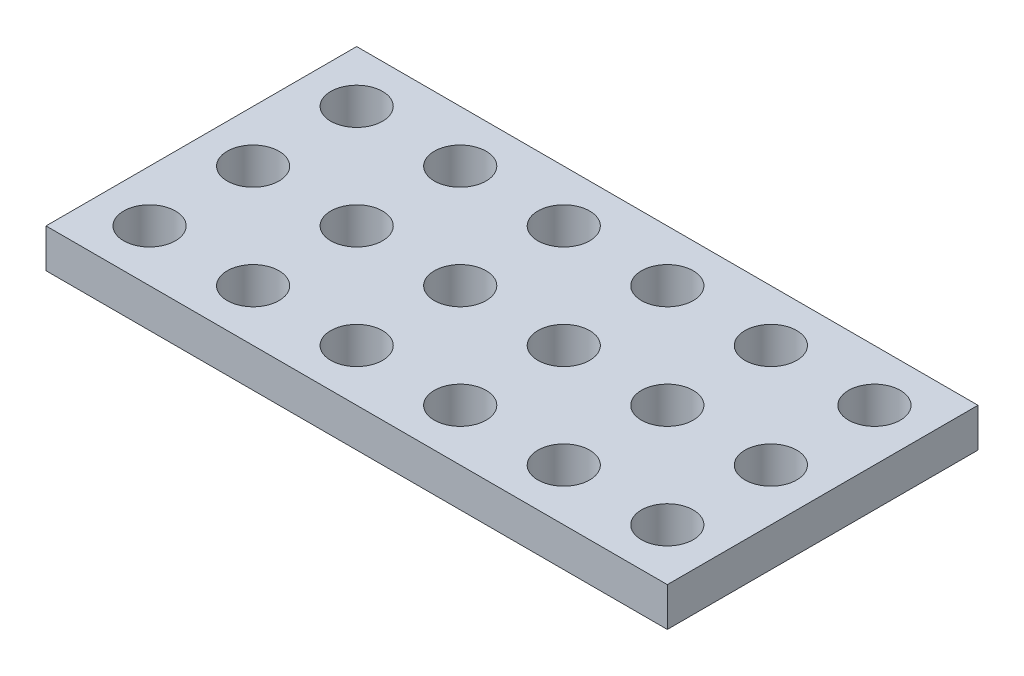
from build123d import *

# Parameters (mm, degrees)
SKETCH_1_W      = 48
SKETCH_1_H      = 24
SKETCH_1_R      = 2
EXTRUDE_1_DEPTH = 3


with BuildPart() as part:
    # Sketch 1 → Extrude 1 (new body)
    with BuildSketch(Plane(origin=(0, 0, 0), x_dir=(1, 0, 0), z_dir=(0, 1, 0))):
        with Locations((2.266666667, -1.066666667)):
            Rectangle(SKETCH_1_W, SKETCH_1_H)
        with Locations(Location((-17.733333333, 6.933333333, 0), (0, 0, 270))):
            Circle(SKETCH_1_R, mode=Mode.SUBTRACT)
        with Locations(Location((-9.733333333, 6.933333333, 0), (0, 0, 270))):
            Circle(SKETCH_1_R, mode=Mode.SUBTRACT)
        with Locations(Location((-1.733333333, 6.933333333, 0), (0, 0, 270))):
            Circle(SKETCH_1_R, mode=Mode.SUBTRACT)
        with Locations(Location((6.266666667, 6.933333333, 0), (0, 0, 270))):
            Circle(SKETCH_1_R, mode=Mode.SUBTRACT)
        with Locations(Location((14.266666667, 6.933333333, 0), (0, 0, 270))):
            Circle(SKETCH_1_R, mode=Mode.SUBTRACT)
        with Locations(Location((22.266666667, 6.933333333, 0), (0, 0, 270))):
            Circle(SKETCH_1_R, mode=Mode.SUBTRACT)
        with Locations(Location((-17.733333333, -1.066666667, 0), (0, 0, 270))):
            Circle(SKETCH_1_R, mode=Mode.SUBTRACT)
        with Locations(Location((-9.733333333, -1.066666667, 0), (0, 0, 270))):
            Circle(SKETCH_1_R, mode=Mode.SUBTRACT)
        with Locations(Location((-1.733333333, -1.066666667, 0), (0, 0, 270))):
            Circle(SKETCH_1_R, mode=Mode.SUBTRACT)
        with Locations(Location((6.266666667, -1.066666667, 0), (0, 0, 270))):
            Circle(SKETCH_1_R, mode=Mode.SUBTRACT)
        with Locations(Location((14.266666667, -1.066666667, 0), (0, 0, 270))):
            Circle(SKETCH_1_R, mode=Mode.SUBTRACT)
        with Locations(Location((22.266666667, -1.066666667, 0), (0, 0, 270))):
            Circle(SKETCH_1_R, mode=Mode.SUBTRACT)
        with Locations(Location((-17.733333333, -9.066666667, 0), (0, 0, 270))):
            Circle(SKETCH_1_R, mode=Mode.SUBTRACT)
        with Locations(Location((-9.733333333, -9.066666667, 0), (0, 0, 270))):
            Circle(SKETCH_1_R, mode=Mode.SUBTRACT)
        with Locations(Location((-1.733333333, -9.066666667, 0), (0, 0, 270))):
            Circle(SKETCH_1_R, mode=Mode.SUBTRACT)
        with Locations(Location((6.266666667, -9.066666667, 0), (0, 0, 270))):
            Circle(SKETCH_1_R, mode=Mode.SUBTRACT)
        with Locations(Location((14.266666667, -9.066666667, 0), (0, 0, 270))):
            Circle(SKETCH_1_R, mode=Mode.SUBTRACT)
        with Locations(Location((22.266666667, -9.066666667, 0), (0, 0, 270))):
            Circle(SKETCH_1_R, mode=Mode.SUBTRACT)
    extrude(amount=EXTRUDE_1_DEPTH)


solid = part.part
